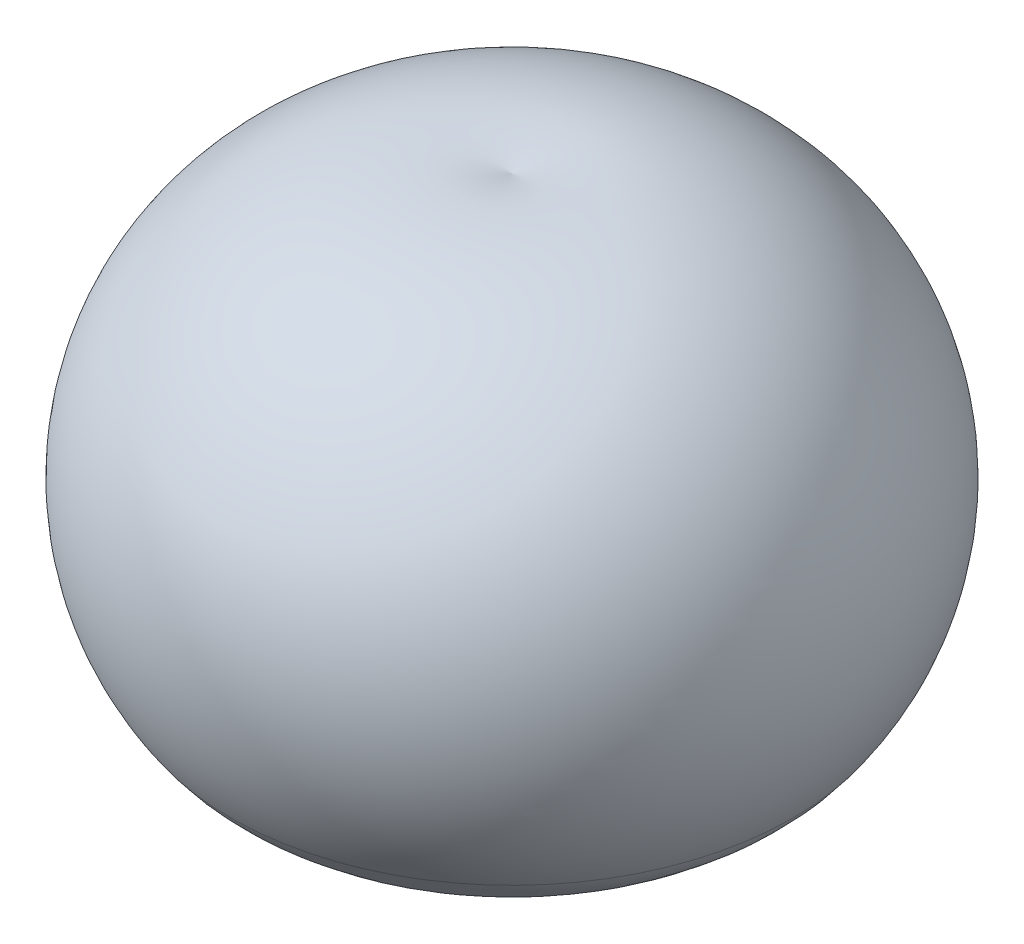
ISO-10303-21;
HEADER;
FILE_DESCRIPTION(('STEP AP214'),'2;1');
FILE_NAME('part.step','',(''),(''),'','','');
FILE_SCHEMA(('AUTOMOTIVE_DESIGN { 1 0 10303 214 1 1 1 1 }'));
ENDSEC;
DATA;
#1=APPLICATION_CONTEXT('core data for automotive mechanical design processes');
#2=APPLICATION_PROTOCOL_DEFINITION('international standard','automotive_design',2000,#1);
#3=PRODUCT_CONTEXT('',#1,'mechanical');
#4=PRODUCT('Part','Part','',(#3));
#5=PRODUCT_RELATED_PRODUCT_CATEGORY('part','',(#4));
#6=PRODUCT_DEFINITION_FORMATION('','',#4);
#7=PRODUCT_DEFINITION_CONTEXT('part definition',#1,'design');
#8=PRODUCT_DEFINITION('design','',#6,#7);
#9=PRODUCT_DEFINITION_SHAPE('','',#8);
#10=(LENGTH_UNIT() NAMED_UNIT(*) SI_UNIT(.MILLI.,.METRE.));
#11=(NAMED_UNIT(*) PLANE_ANGLE_UNIT() SI_UNIT($,.RADIAN.));
#12=(NAMED_UNIT(*) SI_UNIT($,.STERADIAN.) SOLID_ANGLE_UNIT());
#13=UNCERTAINTY_MEASURE_WITH_UNIT(LENGTH_MEASURE(1.E-05),#10,'distance_accuracy_value','');
#14=(GEOMETRIC_REPRESENTATION_CONTEXT(3) GLOBAL_UNCERTAINTY_ASSIGNED_CONTEXT((#13)) GLOBAL_UNIT_ASSIGNED_CONTEXT((#10,
#11,#12)) REPRESENTATION_CONTEXT('',''));
#15=CARTESIAN_POINT('',(0.,0.,0.));
#16=DIRECTION('',(0.,0.,1.));
#17=DIRECTION('',(1.,0.,0.));
#18=AXIS2_PLACEMENT_3D('',#15,#16,#17);
#19=CARTESIAN_POINT('',(1.11022302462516E-13,550.,0.));
#20=DIRECTION('',(0.,-1.,0.));
#21=DIRECTION('',(1.,0.,0.));
#22=AXIS2_PLACEMENT_3D('',#19,#20,#21);
#23=DEGENERATE_TOROIDAL_SURFACE('',#22,400.,443.065884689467,.T.);
#24=CARTESIAN_POINT('',(0.,943.048892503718,0.));
#25=DIRECTION('',(0.,-1.,0.));
#26=DIRECTION('',(1.,0.,0.));
#27=AXIS2_PLACEMENT_3D('',#24,#25,#26);
#28=CIRCLE('',#27,604.499257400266);
#29=CARTESIAN_POINT('',(604.499257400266,943.048892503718,0.));
#30=VERTEX_POINT('',#29);
#31=EDGE_CURVE('E35',#30,#30,#28,.T.);
#32=ORIENTED_EDGE('',*,*,#31,.F.);
#33=EDGE_LOOP('',(#32));
#34=FACE_BOUND('',#33,.T.);
#35=CARTESIAN_POINT('',(1.58049252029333E-13,127.469651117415,0.));
#36=DIRECTION('',(0.,-1.,0.));
#37=DIRECTION('',(1.,0.,0.));
#38=AXIS2_PLACEMENT_3D('',#35,#36,#37);
#39=CIRCLE('',#38,533.324725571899);
#40=CARTESIAN_POINT('',(533.324725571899,127.469651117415,0.));
#41=VERTEX_POINT('',#40);
#42=EDGE_CURVE('E10',#41,#41,#39,.T.);
#43=ORIENTED_EDGE('',*,*,#42,.T.);
#44=EDGE_LOOP('',(#43));
#45=FACE_BOUND('',#44,.T.);
#46=ADVANCED_FACE('F15',(#34,#45),#23,.F.);
#47=CARTESIAN_POINT('',(1.42247325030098E-13,258.376544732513,0.));
#48=DIRECTION('',(0.,-1.,0.));
#49=DIRECTION('',(1.,0.,0.));
#50=AXIS2_PLACEMENT_3D('',#47,#48,#49);
#51=DEGENERATE_TOROIDAL_SURFACE('',#50,29.9503614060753,520.117645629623,.T.);
#52=ORIENTED_EDGE('',*,*,#42,.F.);
#53=EDGE_LOOP('',(#52));
#54=FACE_BOUND('',#53,.T.);
#55=CARTESIAN_POINT('',(2.02410706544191E-13,-233.226311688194,0.));
#56=DIRECTION('',(0.,-1.,0.));
#57=DIRECTION('',(1.,0.,0.));
#58=AXIS2_PLACEMENT_3D('',#55,#56,#57);
#59=CIRCLE('',#58,199.800285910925);
#60=CARTESIAN_POINT('',(199.800285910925,-233.226311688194,0.));
#61=VERTEX_POINT('',#60);
#62=EDGE_CURVE('E22',#61,#61,#59,.T.);
#63=ORIENTED_EDGE('',*,*,#62,.T.);
#64=EDGE_LOOP('',(#63));
#65=FACE_BOUND('',#64,.T.);
#66=ADVANCED_FACE('F44',(#54,#65),#51,.F.);
#67=CARTESIAN_POINT('',(2.22044604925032E-13,56.7242647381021,0.));
#68=DIRECTION('',(0.,-1.,0.));
#69=DIRECTION('',(1.,0.,0.));
#70=AXIS2_PLACEMENT_3D('',#67,#68,#69);
#71=TOROIDAL_SURFACE('',#70,1104.47075808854,950.);
#72=ORIENTED_EDGE('',*,*,#62,.F.);
#73=EDGE_LOOP('',(#72));
#74=FACE_BOUND('',#73,.T.);
#75=CARTESIAN_POINT('',(2.33766259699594E-13,-488.17334979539,0.));
#76=DIRECTION('',(0.,-1.,0.));
#77=DIRECTION('',(1.,0.,0.));
#78=AXIS2_PLACEMENT_3D('',#75,#76,#77);
#79=CIRCLE('',#78,1882.66520016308);
#80=CARTESIAN_POINT('',(1882.66520016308,-488.17334979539,0.));
#81=VERTEX_POINT('',#80);
#82=EDGE_CURVE('E37',#81,#81,#79,.T.);
#83=ORIENTED_EDGE('',*,*,#82,.T.);
#84=EDGE_LOOP('',(#83));
#85=FACE_BOUND('',#84,.T.);
#86=ADVANCED_FACE('F46',(#74,#85),#71,.T.);
#87=CARTESIAN_POINT('',(400.,550.,0.));
#88=DIRECTION('',(0.,0.,-1.));
#89=DIRECTION('',(1.,0.,0.));
#90=AXIS2_PLACEMENT_3D('',#87,#88,#89);
#91=CIRCLE('',#90,1810.);
#92=TRIMMED_CURVE('',#91,(PARAMETER_VALUE(-1.79363036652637)),
(PARAMETER_VALUE(1.79363036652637)),.T.,.PARAMETER.);
#93=CARTESIAN_POINT('',(1.11022302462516E-13,550.,0.));
#94=DIRECTION('',(0.,-1.,0.));
#95=AXIS1_PLACEMENT('',#93,#94);
#96=SURFACE_OF_REVOLUTION('',#92,#95);
#97=ORIENTED_EDGE('',*,*,#82,.F.);
#98=EDGE_LOOP('',(#97));
#99=FACE_BOUND('',#98,.T.);
#100=CARTESIAN_POINT('',(-4.9960036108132E-13,2315.24785795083,0.));
#101=VERTEX_POINT('',#100);
#102=VERTEX_LOOP('',#101);
#103=FACE_BOUND('',#102,.T.);
#104=ADVANCED_FACE('F31',(#99,#103),#96,.T.);
#105=CARTESIAN_POINT('',(-344.781847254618,980.,0.));
#106=DIRECTION('',(0.,0.,-1.));
#107=DIRECTION('',(1.,0.,0.));
#108=AXIS2_PLACEMENT_3D('',#105,#106,#107);
#109=CIRCLE('',#108,950.);
#110=TRIMMED_CURVE('',#109,(PARAMETER_VALUE(-1.19938782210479)),
(PARAMETER_VALUE(1.19938782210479)),.T.,.PARAMETER.);
#111=CARTESIAN_POINT('',(0.,980.,0.));
#112=DIRECTION('',(0.,-1.,0.));
#113=AXIS1_PLACEMENT('',#111,#112);
#114=SURFACE_OF_REVOLUTION('',#110,#113);
#115=CARTESIAN_POINT('',(0.,1865.22622973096,0.));
#116=VERTEX_POINT('',#115);
#117=VERTEX_LOOP('',#116);
#118=FACE_BOUND('',#117,.T.);
#119=ORIENTED_EDGE('',*,*,#31,.T.);
#120=EDGE_LOOP('',(#119));
#121=FACE_BOUND('',#120,.T.);
#122=ADVANCED_FACE('F28',(#118,#121),#114,.F.);
#123=CLOSED_SHELL('',(#46,#66,#86,#104,#122));
#124=MANIFOLD_SOLID_BREP('B1',#123);
#125=ADVANCED_BREP_SHAPE_REPRESENTATION('',(#18,#124),#14);
#126=SHAPE_DEFINITION_REPRESENTATION(#9,#125);
ENDSEC;
END-ISO-10303-21;
